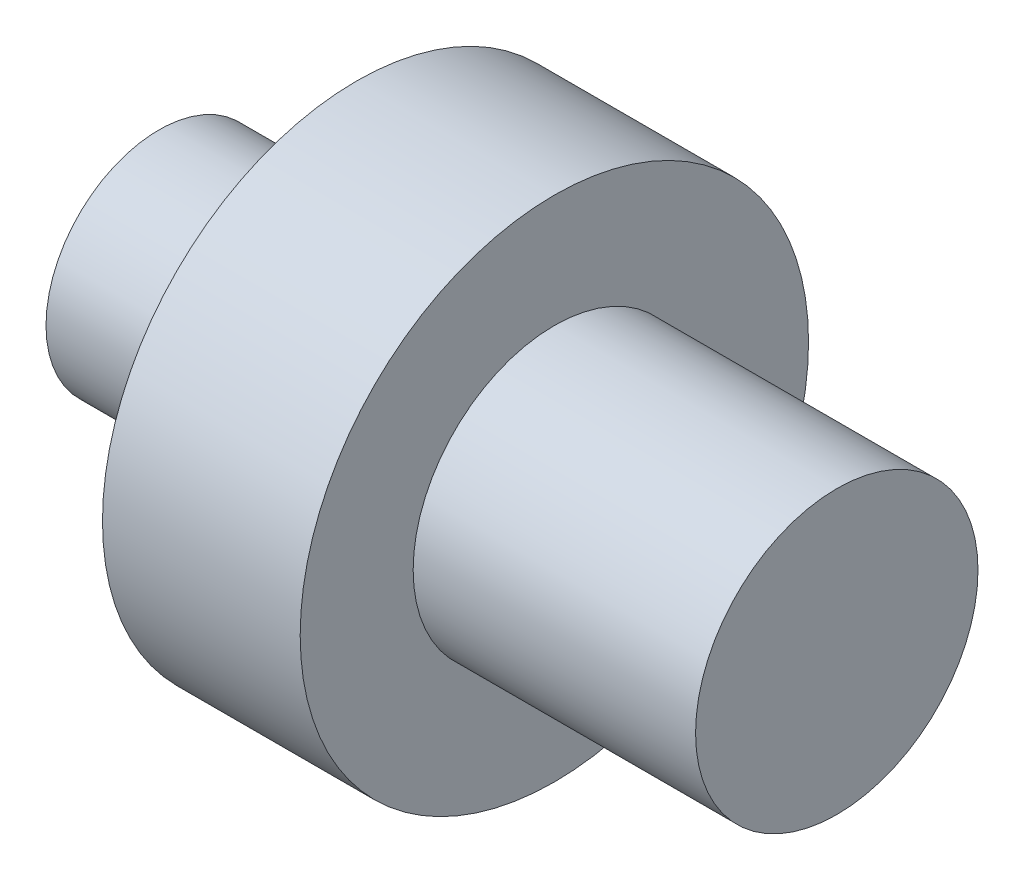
ISO-10303-21;
HEADER;
FILE_DESCRIPTION(('STEP AP214'),'2;1');
FILE_NAME('part.step','',(''),(''),'','','');
FILE_SCHEMA(('AUTOMOTIVE_DESIGN { 1 0 10303 214 1 1 1 1 }'));
ENDSEC;
DATA;
#1=APPLICATION_CONTEXT('core data for automotive mechanical design processes');
#2=APPLICATION_PROTOCOL_DEFINITION('international standard','automotive_design',2000,#1);
#3=PRODUCT_CONTEXT('',#1,'mechanical');
#4=PRODUCT('Part','Part','',(#3));
#5=PRODUCT_RELATED_PRODUCT_CATEGORY('part','',(#4));
#6=PRODUCT_DEFINITION_FORMATION('','',#4);
#7=PRODUCT_DEFINITION_CONTEXT('part definition',#1,'design');
#8=PRODUCT_DEFINITION('design','',#6,#7);
#9=PRODUCT_DEFINITION_SHAPE('','',#8);
#10=(LENGTH_UNIT() NAMED_UNIT(*) SI_UNIT(.MILLI.,.METRE.));
#11=(NAMED_UNIT(*) PLANE_ANGLE_UNIT() SI_UNIT($,.RADIAN.));
#12=(NAMED_UNIT(*) SI_UNIT($,.STERADIAN.) SOLID_ANGLE_UNIT());
#13=UNCERTAINTY_MEASURE_WITH_UNIT(LENGTH_MEASURE(1.E-05),#10,'distance_accuracy_value','');
#14=(GEOMETRIC_REPRESENTATION_CONTEXT(3) GLOBAL_UNCERTAINTY_ASSIGNED_CONTEXT((#13)) GLOBAL_UNIT_ASSIGNED_CONTEXT((#10,
#11,#12)) REPRESENTATION_CONTEXT('',''));
#15=CARTESIAN_POINT('',(0.,0.,0.));
#16=DIRECTION('',(0.,0.,1.));
#17=DIRECTION('',(1.,0.,0.));
#18=AXIS2_PLACEMENT_3D('',#15,#16,#17);
#19=CARTESIAN_POINT('',(-68.,0.,0.));
#20=DIRECTION('',(-1.,0.,0.));
#21=DIRECTION('',(0.,0.,1.));
#22=AXIS2_PLACEMENT_3D('',#19,#20,#21);
#23=PLANE('',#22);
#24=CARTESIAN_POINT('',(-68.,0.,0.));
#25=DIRECTION('',(-1.,0.,0.));
#26=DIRECTION('',(0.,0.,1.));
#27=AXIS2_PLACEMENT_3D('',#24,#25,#26);
#28=CIRCLE('',#27,36.);
#29=CARTESIAN_POINT('',(-68.,0.,36.));
#30=VERTEX_POINT('',#29);
#31=EDGE_CURVE('E40',#30,#30,#28,.T.);
#32=ORIENTED_EDGE('',*,*,#31,.T.);
#33=EDGE_LOOP('',(#32));
#34=FACE_BOUND('',#33,.T.);
#35=CARTESIAN_POINT('',(-68.,0.,0.));
#36=DIRECTION('',(-1.,0.,0.));
#37=DIRECTION('',(0.,0.,1.));
#38=AXIS2_PLACEMENT_3D('',#35,#36,#37);
#39=CIRCLE('',#38,16.);
#40=CARTESIAN_POINT('',(-68.,0.,16.));
#41=VERTEX_POINT('',#40);
#42=EDGE_CURVE('E50',#41,#41,#39,.T.);
#43=ORIENTED_EDGE('',*,*,#42,.F.);
#44=EDGE_LOOP('',(#43));
#45=FACE_BOUND('',#44,.T.);
#46=ADVANCED_FACE('F29',(#34,#45),#23,.T.);
#47=CARTESIAN_POINT('',(-40.,0.,0.));
#48=DIRECTION('',(1.,0.,0.));
#49=DIRECTION('',(0.,0.,-1.));
#50=AXIS2_PLACEMENT_3D('',#47,#48,#49);
#51=CYLINDRICAL_SURFACE('',#50,20.);
#52=CARTESIAN_POINT('',(-40.,0.,0.));
#53=DIRECTION('',(-1.,0.,0.));
#54=DIRECTION('',(0.,0.,1.));
#55=AXIS2_PLACEMENT_3D('',#52,#53,#54);
#56=CIRCLE('',#55,20.);
#57=CARTESIAN_POINT('',(-40.,0.,20.));
#58=VERTEX_POINT('',#57);
#59=EDGE_CURVE('E36',#58,#58,#56,.F.);
#60=ORIENTED_EDGE('',*,*,#59,.T.);
#61=EDGE_LOOP('',(#60));
#62=FACE_BOUND('',#61,.T.);
#63=CARTESIAN_POINT('',(0.,0.,0.));
#64=DIRECTION('',(1.,0.,0.));
#65=DIRECTION('',(0.,0.,-1.));
#66=AXIS2_PLACEMENT_3D('',#63,#64,#65);
#67=CIRCLE('',#66,20.);
#68=CARTESIAN_POINT('',(0.,0.,-20.));
#69=VERTEX_POINT('',#68);
#70=EDGE_CURVE('E10',#69,#69,#67,.T.);
#71=ORIENTED_EDGE('',*,*,#70,.F.);
#72=EDGE_LOOP('',(#71));
#73=FACE_BOUND('',#72,.T.);
#74=ADVANCED_FACE('F31',(#62,#73),#51,.T.);
#75=CARTESIAN_POINT('',(0.,0.,0.));
#76=DIRECTION('',(1.,0.,0.));
#77=DIRECTION('',(0.,0.,-1.));
#78=AXIS2_PLACEMENT_3D('',#75,#76,#77);
#79=PLANE('',#78);
#80=ORIENTED_EDGE('',*,*,#70,.T.);
#81=EDGE_LOOP('',(#80));
#82=FACE_BOUND('',#81,.T.);
#83=ADVANCED_FACE('F71',(#82),#79,.T.);
#84=CARTESIAN_POINT('',(-68.,0.,0.));
#85=DIRECTION('',(1.,0.,0.));
#86=DIRECTION('',(0.,0.,-1.));
#87=AXIS2_PLACEMENT_3D('',#84,#85,#86);
#88=CYLINDRICAL_SURFACE('',#87,36.);
#89=ORIENTED_EDGE('',*,*,#31,.F.);
#90=EDGE_LOOP('',(#89));
#91=FACE_BOUND('',#90,.T.);
#92=CARTESIAN_POINT('',(-40.,0.,0.));
#93=DIRECTION('',(-1.,0.,0.));
#94=DIRECTION('',(0.,0.,1.));
#95=AXIS2_PLACEMENT_3D('',#92,#93,#94);
#96=CIRCLE('',#95,36.);
#97=CARTESIAN_POINT('',(-40.,0.,36.));
#98=VERTEX_POINT('',#97);
#99=EDGE_CURVE('E44',#98,#98,#96,.T.);
#100=ORIENTED_EDGE('',*,*,#99,.T.);
#101=EDGE_LOOP('',(#100));
#102=FACE_BOUND('',#101,.T.);
#103=ADVANCED_FACE('F76',(#91,#102),#88,.T.);
#104=CARTESIAN_POINT('',(-40.,0.,0.));
#105=DIRECTION('',(-1.,0.,0.));
#106=DIRECTION('',(0.,0.,1.));
#107=AXIS2_PLACEMENT_3D('',#104,#105,#106);
#108=PLANE('',#107);
#109=ORIENTED_EDGE('',*,*,#59,.F.);
#110=EDGE_LOOP('',(#109));
#111=FACE_BOUND('',#110,.T.);
#112=ORIENTED_EDGE('',*,*,#99,.F.);
#113=EDGE_LOOP('',(#112));
#114=FACE_BOUND('',#113,.T.);
#115=ADVANCED_FACE('F61',(#111,#114),#108,.F.);
#116=CARTESIAN_POINT('',(-96.,0.,0.));
#117=DIRECTION('',(1.,0.,0.));
#118=DIRECTION('',(0.,0.,-1.));
#119=AXIS2_PLACEMENT_3D('',#116,#117,#118);
#120=CYLINDRICAL_SURFACE('',#119,16.);
#121=CARTESIAN_POINT('',(-96.,0.,0.));
#122=DIRECTION('',(-1.,0.,0.));
#123=DIRECTION('',(0.,0.,1.));
#124=AXIS2_PLACEMENT_3D('',#121,#122,#123);
#125=CIRCLE('',#124,16.);
#126=CARTESIAN_POINT('',(-96.,0.,16.));
#127=VERTEX_POINT('',#126);
#128=EDGE_CURVE('E48',#127,#127,#125,.T.);
#129=ORIENTED_EDGE('',*,*,#128,.F.);
#130=EDGE_LOOP('',(#129));
#131=FACE_BOUND('',#130,.T.);
#132=ORIENTED_EDGE('',*,*,#42,.T.);
#133=EDGE_LOOP('',(#132));
#134=FACE_BOUND('',#133,.T.);
#135=ADVANCED_FACE('F58',(#131,#134),#120,.T.);
#136=CARTESIAN_POINT('',(-96.,0.,0.));
#137=DIRECTION('',(-1.,0.,0.));
#138=DIRECTION('',(0.,0.,1.));
#139=AXIS2_PLACEMENT_3D('',#136,#137,#138);
#140=PLANE('',#139);
#141=ORIENTED_EDGE('',*,*,#128,.T.);
#142=EDGE_LOOP('',(#141));
#143=FACE_BOUND('',#142,.T.);
#144=ADVANCED_FACE('F56',(#143),#140,.T.);
#145=CLOSED_SHELL('',(#46,#74,#83,#103,#115,#135,#144));
#146=MANIFOLD_SOLID_BREP('B2',#145);
#147=ADVANCED_BREP_SHAPE_REPRESENTATION('',(#18,#146),#14);
#148=SHAPE_DEFINITION_REPRESENTATION(#9,#147);
ENDSEC;
END-ISO-10303-21;
